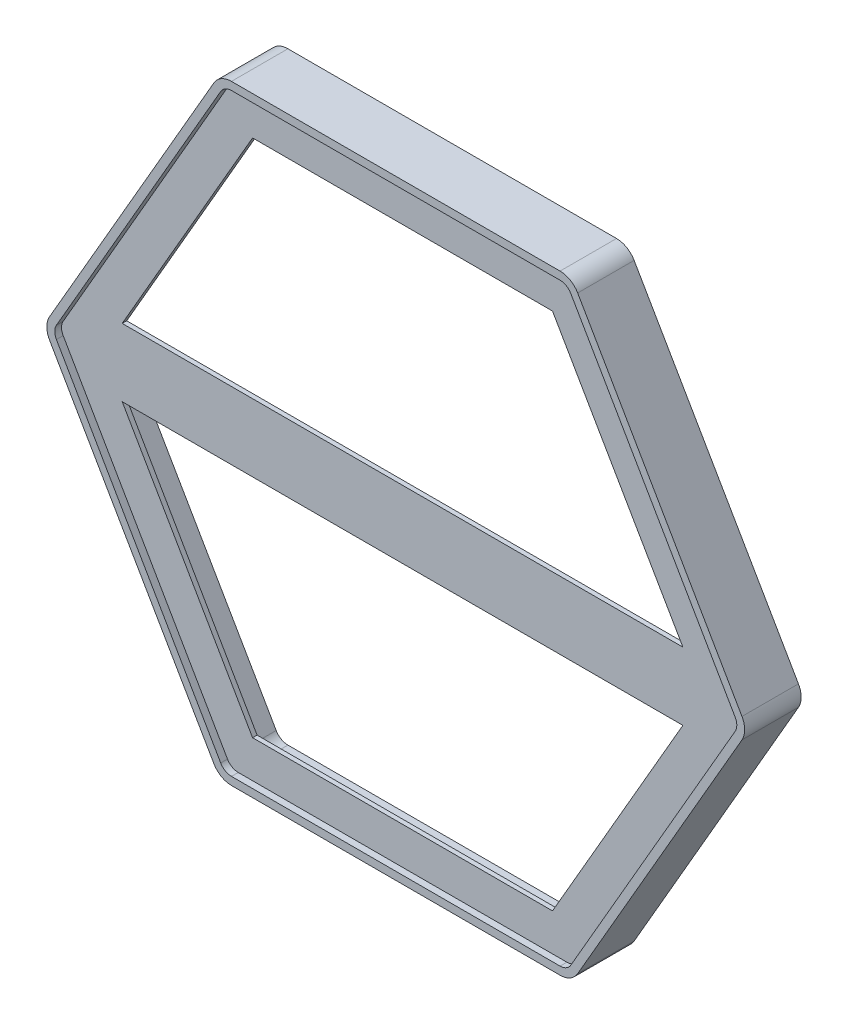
from build123d import *

# Parameters (mm, degrees)
EXTRUDE1_DEPTH     = 6.35
EXTRUDE2_START     = 25.4
EXTRUDE2_DEPTH     = 25.4
CUT_EXTRUDE1_DEPTH = 263.487404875
CUT_EXTRUDE2_DEPTH = 3.81


with BuildPart() as part:
    # Sketch1 → Extrude1 (new body)
    with BuildSketch(Plane.XY):
        with BuildLine():
            Line((102.286260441, -165.735), (194.673850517, -5.715))
            ThreePointArc((194.673850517, -5.715), (196.205180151, 0), (194.673850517, 5.715))
            Line((194.673850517, 5.715), (102.286260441, 165.735))
            ThreePointArc((102.286260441, 165.735), (98.102590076, 169.918670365), (92.387590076, 171.45))
            Line((92.387590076, 171.45), (-92.387590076, 171.45))
            ThreePointArc((-92.387590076, 171.45), (-98.102590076, 169.918670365), (-102.286260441, 165.735))
            Line((-102.286260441, 165.735), (-194.673850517, 5.715))
            ThreePointArc((-194.673850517, 5.715), (-196.205180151, 0), (-194.673850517, -5.715))
            Line((-194.673850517, -5.715), (-102.286260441, -165.735))
            ThreePointArc((-102.286260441, -165.735), (-98.102590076, -169.918670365), (-92.387590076, -171.45))
            Line((-92.387590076, -171.45), (92.387590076, -171.45))
            ThreePointArc((92.387590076, -171.45), (98.102590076, -169.918670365), (102.286260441, -165.735))
        make_face()
    extrude(amount=EXTRUDE1_DEPTH)

    # Sketch3 → Extrude2 (add)
    with BuildSketch(Plane(origin=(0, 0, 0), x_dir=(-1, 0, 0), z_dir=(0, 0, -1)).offset(EXTRUDE2_START)):
        with BuildLine():
            Line((-92.387590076, 171.45), (92.387590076, 171.45))
            ThreePointArc((92.387590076, 171.45), (98.102590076, 169.918670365), (102.286260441, 165.735))
            Line((102.286260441, 165.735), (194.673850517, 5.715))
            ThreePointArc((194.673850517, 5.715), (196.205180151, 0), (194.673850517, -5.715))
            Line((194.673850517, -5.715), (102.286260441, -165.735))
            ThreePointArc((102.286260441, -165.735), (98.102590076, -169.918670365), (92.387590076, -171.45))
            Line((92.387590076, -171.45), (-92.387590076, -171.45))
            ThreePointArc((-92.387590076, -171.45), (-98.102590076, -169.918670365), (-102.286260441, -165.735))
            Line((-102.286260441, -165.735), (-194.673850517, -5.715))
            ThreePointArc((-194.673850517, -5.715), (-196.205180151, 0), (-194.673850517, 5.715))
            Line((-194.673850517, 5.715), (-102.286260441, 165.735))
            ThreePointArc((-102.286260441, 165.735), (-98.102590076, 169.918670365), (-92.387590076, 171.45))
        make_face()
        with BuildLine():
            Line((-191.374293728, 3.81), (-98.986703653, 163.83))
            ThreePointArc((-98.986703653, 163.83), (-96.197590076, 166.619113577), (-92.387590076, 167.64))
            Line((-92.387590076, 167.64), (92.387590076, 167.64))
            ThreePointArc((92.387590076, 167.64), (96.197590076, 166.619113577), (98.986703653, 163.83))
            Line((98.986703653, 163.83), (191.374293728, 3.81))
            ThreePointArc((191.374293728, 3.81), (192.395180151, 0), (191.374293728, -3.81))
            Line((191.374293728, -3.81), (98.986703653, -163.83))
            ThreePointArc((98.986703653, -163.83), (96.197590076, -166.619113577), (92.387590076, -167.64))
            Line((92.387590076, -167.64), (-92.387590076, -167.64))
            ThreePointArc((-92.387590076, -167.64), (-96.197590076, -166.619113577), (-98.986703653, -163.83))
            Line((-98.986703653, -163.83), (-191.374293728, -3.81))
            ThreePointArc((-191.374293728, -3.81), (-192.395180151, 0), (-191.374293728, 3.81))
        make_face(mode=Mode.SUBTRACT)
    extrude(amount=-EXTRUDE2_DEPTH)

    # Sketch4 → Cut-Extrude1 (cut, through all)
    with BuildSketch(Plane.XY.offset(6.35)):
        Polygon((-157.645491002, -19.05), (157.645491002, -19.05), (84.322006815, -146.05), (-84.322006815, -146.05), align=None)
        Polygon((-157.645491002, 19.05), (157.645491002, 19.05), (84.322006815, 146.05), (-84.322006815, 146.05), align=None)
    extrude(amount=-CUT_EXTRUDE1_DEPTH, mode=Mode.SUBTRACT)

    # Sketch6 → Cut-Extrude2 (cut)
    with BuildSketch(Plane.XY.offset(6.35)):
        with BuildLine():
            Line((190.824367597, 3.4925), (98.436777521, 163.5125))
            ThreePointArc((98.436777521, 163.5125), (95.880090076, 166.069187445), (92.387590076, 167.005))
            Line((92.387590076, 167.005), (-92.387590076, 167.005))
            ThreePointArc((-92.387590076, 167.005), (-95.880090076, 166.069187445), (-98.436777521, 163.5125))
            Line((-98.436777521, 163.5125), (-190.824367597, 3.4925))
            ThreePointArc((-190.824367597, 3.4925), (-191.760180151, 0), (-190.824367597, -3.4925))
            Line((-190.824367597, -3.4925), (-98.436777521, -163.5125))
            ThreePointArc((-98.436777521, -163.5125), (-95.880090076, -166.069187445), (-92.387590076, -167.005))
            Line((-92.387590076, -167.005), (92.387590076, -167.005))
            ThreePointArc((92.387590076, -167.005), (95.880090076, -166.069187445), (98.436777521, -163.5125))
            Line((98.436777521, -163.5125), (190.824367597, -3.4925))
            ThreePointArc((190.824367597, -3.4925), (191.760180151, 0), (190.824367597, 3.4925))
        make_face()
    extrude(amount=-CUT_EXTRUDE2_DEPTH, mode=Mode.SUBTRACT)


solid = part.part
